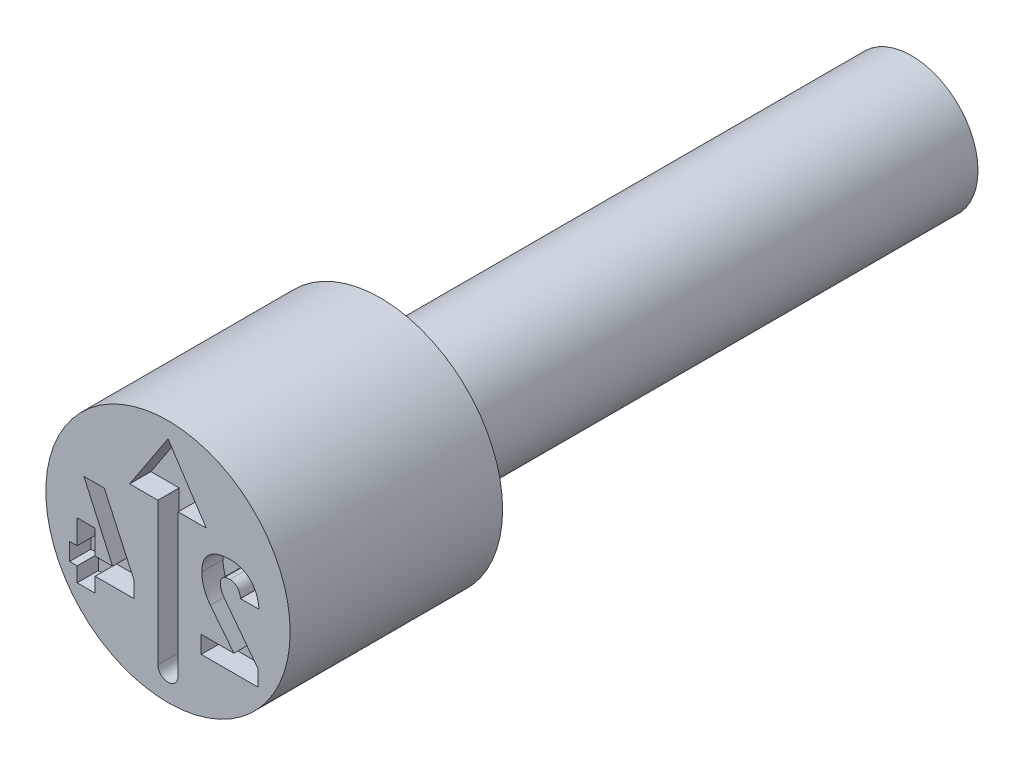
from build123d import *

# Parameters (mm, degrees)
CUT_EXTRUDE4_DEPTH = 0.4
SKETCH4_W          = 0.339311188
SKETCH4_H          = 1.059751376
CUT_EXTRUDE5_DEPTH = 0.4


with BuildPart() as part:
    # Sketch2 → Revolve1 (revolve)
    with BuildSketch(Plane(origin=(0, 0, 0), x_dir=(0, 0, -1), z_dir=(1, 0, 0)), mode=Mode.PRIVATE) as revolve1_sk:
        Polygon((0, 2.3), (0, 0), (14, 0), (14, 1.25), (4, 1.25), (4, 2.3), align=None)
    revolve(revolve1_sk.sketch.rotate(Axis((0, 0, -0.403888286), (0, 0, -1)), 90), axis=Axis((0, 0, -0.403888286), (0, 0, -1)))

    # Sketch3 → Cut-Extrude4 (cut)
    with BuildSketch(Plane.XY):
        with BuildLine():
            Line((0.190473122, 0.906351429), (0.190473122, -1.776161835))
            ThreePointArc((0.190473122, -1.776161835), (0, -1.966634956), (-0.190473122, -1.776161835))
            Line((-0.190473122, -1.776161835), (-0.190473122, 0.906351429))
            Line((-0.190473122, 0.906351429), (-0.721917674, 0.906351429))
            Line((-0.721917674, 0.906351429), (0, 2.002115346))
            Line((0, 2.002115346), (0.721917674, 0.906351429))
            Line((0.721917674, 0.906351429), (0.190473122, 0.906351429))
        make_face()
    extrude(amount=-CUT_EXTRUDE4_DEPTH, mode=Mode.SUBTRACT)

    # Sketch4 → Cut-Extrude5 (cut)
    with BuildSketch(Plane.XY):
        with BuildLine():
            Line((1.690282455, -0.894069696), (1.072552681, -0.081923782))
            add(Edge.make_bspline(
                [(1.072552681, -0.081923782), (1.059597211, -0.063949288), (1.034305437, -0.028859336), (1.011677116, 0.019539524), (0.997302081, 0.057489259), (0.990656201, 0.085017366), (0.985736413, 0.111340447), (0.985162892, 0.128611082), (0.984882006, 0.137069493)],
                knots=[0, 0, 0, 0, 1.660423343, 3.241491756, 3.993801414, 4.704207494, 5.365376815, 6, 6, 6, 6], degree=3))
            Line((0.984882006, 0.137069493), (0.984882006, 0.139637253))
            add(Edge.make_bspline(
                [(0.984882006, 0.139637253), (0.985374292, 0.151195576), (0.986312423, 0.173221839), (0.995369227, 0.204210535), (1.010345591, 0.231007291), (1.031323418, 0.253470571), (1.058007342, 0.27073464), (1.089482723, 0.28334591), (1.125916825, 0.29048152), (1.15175486, 0.291390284), (1.165358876, 0.291868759)],
                knots=[0, 0, 0, 0, 1.033361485, 1.969238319, 2.861873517, 3.760870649, 4.693536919, 5.686153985, 6.781734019, 8, 8, 8, 8], degree=3))
            add(Edge.make_bspline(
                [(1.165358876, 0.291868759), (1.178754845, 0.291302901), (1.204752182, 0.29020475), (1.241733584, 0.279740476), (1.274585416, 0.261975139), (1.303023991, 0.237423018), (1.326886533, 0.206536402), (1.344475, 0.169328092), (1.358639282, 0.12703926), (1.362749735, 0.0963466), (1.364910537, 0.080211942)],
                knots=[0, 0, 0, 0, 0.993701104, 1.928459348, 2.826878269, 3.748294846, 4.700551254, 5.70417143, 6.793118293, 8, 8, 8, 8], degree=3))
            Line((1.364910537, 0.080211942), (1.364910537, 0.07874465))
            Line((1.364910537, 0.07874465), (1.712658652, 0.07874465))
            Line((1.712658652, 0.07874465), (1.712658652, 0.080211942))
            add(Edge.make_bspline(
                [(1.712658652, 0.080211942), (1.710167, 0.107310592), (1.705313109, 0.160100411), (1.688808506, 0.236016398), (1.66442642, 0.305870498), (1.633274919, 0.369855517), (1.595077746, 0.427163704), (1.55075766, 0.477779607), (1.499823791, 0.520720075), (1.44315838, 0.556401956), (1.381008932, 0.584326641), (1.314135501, 0.604672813), (1.24243737, 0.616402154), (1.193157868, 0.617927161), (1.167926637, 0.618707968)],
                knots=[0, 0, 0, 0, 1.143950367, 2.228484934, 3.258162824, 4.249580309, 5.213917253, 6.146796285, 7.070112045, 8.006232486, 8.954636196, 9.927630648, 10.9389416, 12, 12, 12, 12], degree=3))
            add(Edge.make_bspline(
                [(1.167926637, 0.618707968), (1.140870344, 0.61814235), (1.088504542, 0.617047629), (1.013101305, 0.606742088), (0.943766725, 0.589592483), (0.880674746, 0.565497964), (0.824239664, 0.534525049), (0.774200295, 0.497760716), (0.731969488, 0.45377777), (0.696841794, 0.403812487), (0.669150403, 0.348057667), (0.649758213, 0.286561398), (0.637882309, 0.219817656), (0.63641996, 0.173435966), (0.6356666, 0.149541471)],
                knots=[0, 0, 0, 0, 1.208591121, 2.339154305, 3.392741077, 4.394302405, 5.348037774, 6.261656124, 7.158186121, 8.060194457, 8.981460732, 9.928425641, 10.932785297, 12, 12, 12, 12], degree=3))
            Line((0.6356666, 0.149541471), (0.6356666, 0.14807418))
            add(Edge.make_bspline(
                [(0.6356666, 0.14807418), (0.636136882, 0.127628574), (0.637078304, 0.086700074), (0.645474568, 0.025554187), (0.659203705, -0.035238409), (0.677832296, -0.095464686), (0.701094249, -0.15411899), (0.728855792, -0.210266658), (0.760551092, -0.263764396), (0.785386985, -0.296849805), (0.797802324, -0.313389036)],
                knots=[0, 0, 0, 0, 0.985191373, 1.972179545, 2.968870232, 3.986806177, 5.007996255, 6.007036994, 7.003727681, 8, 8, 8, 8], degree=3))
            Line((0.797802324, -0.313389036), (1.240924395, -0.873160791))
            Line((1.240924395, -0.873160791), (0.625762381, -0.873160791))
            Line((0.625762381, -0.873160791), (0.625762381, -1.2))
            Line((0.625762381, -1.2), (1.690282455, -1.2))
            Line((1.690282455, -1.2), (1.690282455, -0.894069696))
        make_face()
        Polygon((-0.644560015, -0.611982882), (-1.199196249, 0.598899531), (-1.583259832, 0.598899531), (-1.043296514, -0.596943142), (-1.851774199, -0.596943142), (-1.851774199, -0.923782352), (-0.644560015, -0.923782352), align=None)
        with Locations((-1.540891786, -0.671224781)):
            Rectangle(SKETCH4_W, SKETCH4_H)
    extrude(amount=-CUT_EXTRUDE5_DEPTH, mode=Mode.SUBTRACT)


solid = part.part
